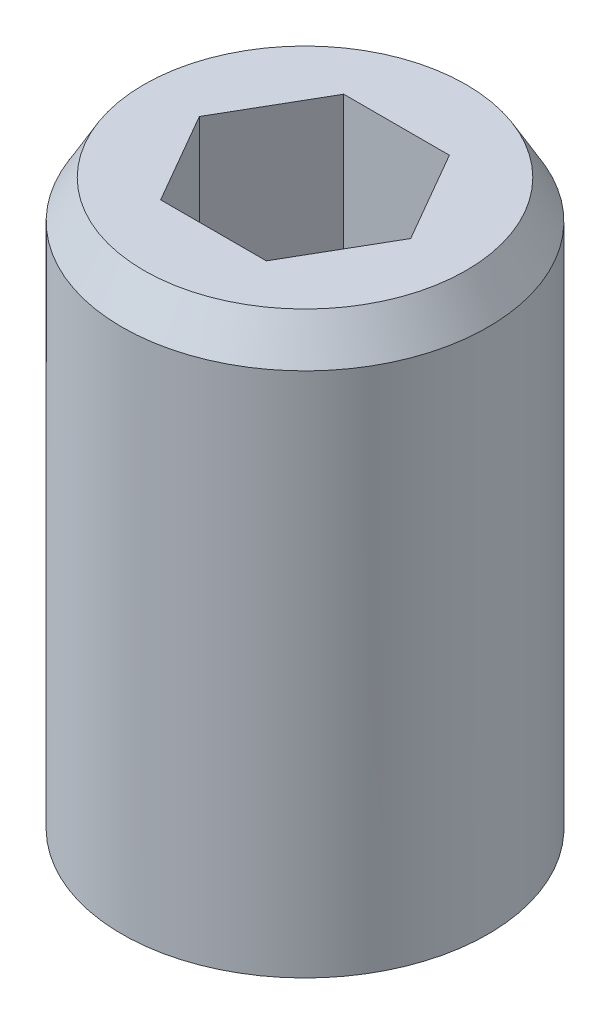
from build123d import *
from OCP.BRepFilletAPI import BRepFilletAPI_MakeChamfer

# Parameters (mm, degrees)
ESQUISSE1_W             = 2.5
ESQUISSE1_H             = 8
CHANFREIN1_SIZE         = 0.3
CHANFREIN1_SIZE2        = 0.519615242
ENL_V_MAT_EXTRU_1_DEPTH = 2.5


with BuildPart() as part:
    # Esquisse1 → R_volution1 (revolve)
    with BuildSketch(Plane.XY, mode=Mode.PRIVATE) as r_volution1_sk:
        with Locations((1.25, 4)):
            Rectangle(ESQUISSE1_W, ESQUISSE1_H)
    revolve(r_volution1_sk.sketch.rotate(Axis((0, 0, 0), (0, 1, 0)), 90), axis=Axis((0, 0, 0), (0, 1, 0)))

    # Chanfrein1: one chamfer whose edges measure the first distance from different faces: ONE call of the kernel's chamfer builder (chamfer() names one face for all edges)
    chanfrein1_edges_1 = [part.edges().sort_by_distance(p)[0] for p in [
        (0, 8, 2.5),
    ]]
    chanfrein1_side_1 = [part.faces().sort_by_distance(p)[0] for p in [
        (0, 8, 0),
    ]]
    chanfrein1_edges_2 = [part.edges().sort_by_distance(p)[0] for p in [
        (0, 0, 2.5),
    ]]
    chanfrein1_side_2 = [part.faces().sort_by_distance(p)[0] for p in [
        (0, 4, 2.5),
    ]]
    chanfrein1 = BRepFilletAPI_MakeChamfer(part.part.solid().wrapped)
    for e in chanfrein1_edges_1:
        chanfrein1.Add(CHANFREIN1_SIZE, CHANFREIN1_SIZE2, e.wrapped, chanfrein1_side_1[0].wrapped)  # the first distance lies on this face
    for e in chanfrein1_edges_2:
        chanfrein1.Add(CHANFREIN1_SIZE, CHANFREIN1_SIZE2, e.wrapped, chanfrein1_side_2[0].wrapped)  # the first distance lies on this face
    add(Compound.cast(chanfrein1.Shape()), mode=Mode.REPLACE)

    # Esquisse2 → Enl_v. mat.-Extru.1 (cut)
    with BuildSketch(Plane(origin=(0, 8, 0), x_dir=(-1, 0, 0), z_dir=(0, 1, 0))):
        Polygon((0.721687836, -1.25), (1.443375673, 0), (0.721687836, 1.25), (-0.721687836, 1.25), (-1.443375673, 0), (-0.721687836, -1.25), align=None)
    extrude(amount=-ENL_V_MAT_EXTRU_1_DEPTH, mode=Mode.SUBTRACT)


solid = part.part
